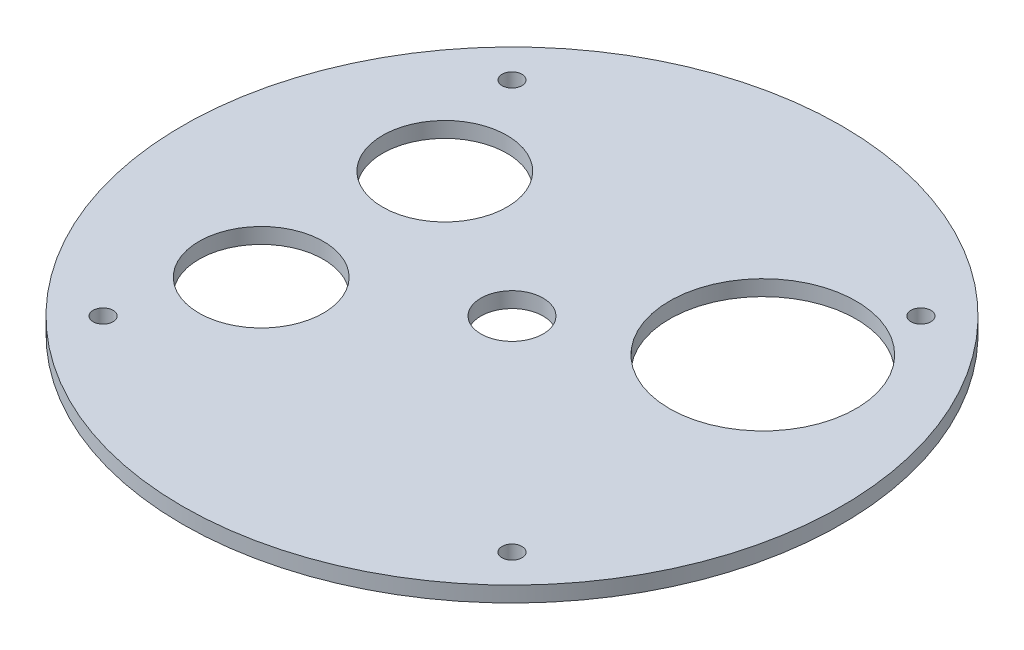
from build123d import *

# Parameters (mm, degrees)
SKETCH1_R           = 67.31
BOSS_EXTRUDE1_DEPTH = 3.175
SKETCH2_R           = 12.7
SKETCH2_R_2         = 19.05
SKETCH2_R_3         = 1.919694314
SKETCH2_R_4         = 2.032
CUT_EXTRUDE1_DEPTH  = 96.243649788
SKETCH3_R           = 6.35
CUT_EXTRUDE2_DEPTH  = 96.243649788


with BuildPart() as part:
    # Sketch1 → Boss-Extrude1 (new body)
    with BuildSketch(Plane(origin=(0, 0, 0), x_dir=(1, 0, 0), z_dir=(0, 1, 0))):
        with Locations(Location((0, 0, 0), (0, 0, 270))):
            Circle(SKETCH1_R)
    extrude(amount=BOSS_EXTRUDE1_DEPTH)

    # Sketch2 → Cut-Extrude1 (cut, through all)
    with BuildSketch(Plane(origin=(0, 3.175, 0), x_dir=(1, 0, 0), z_dir=(0, 1, 0))):
        with Locations(Location((-32.475952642, 18.75, 0), (0, 0, 270))):
            Circle(SKETCH2_R)
        with Locations(Location((32.475952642, 18.75, 0), (0, 0, 270))):
            Circle(SKETCH2_R_2)
        with Locations(Location((-32.475952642, -18.75, 0), (0, 0, 270))):
            Circle(SKETCH2_R)
        with Locations(Location((0, 0, 0), (0, 0, 270))):
            Circle(SKETCH2_R_3)
        with Locations(Location((41.758190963, -41.758190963, 0), (0, 0, 270))):
            Circle(SKETCH2_R_4)
        with Locations(Location((41.758190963, 41.758190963, 0), (0, 0, 270))):
            Circle(SKETCH2_R_4)
        with Locations(Location((-41.758190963, 41.758190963, 0), (0, 0, 90))):
            Circle(SKETCH2_R_4)
        with Locations(Location((-41.758190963, -41.758190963, 0), (0, 0, 270))):
            Circle(SKETCH2_R_4)
    extrude(amount=-CUT_EXTRUDE1_DEPTH, mode=Mode.SUBTRACT)

    # Sketch3 → Cut-Extrude2 (cut, through all)
    with BuildSketch(Plane(origin=(0, 3.175, 0), x_dir=(1, 0, 0), z_dir=(0, 1, 0))):
        with Locations(Location((0, 0, 0), (0, 0, 270))):
            Circle(SKETCH3_R)
    extrude(amount=-CUT_EXTRUDE2_DEPTH, mode=Mode.SUBTRACT)


solid = part.part
